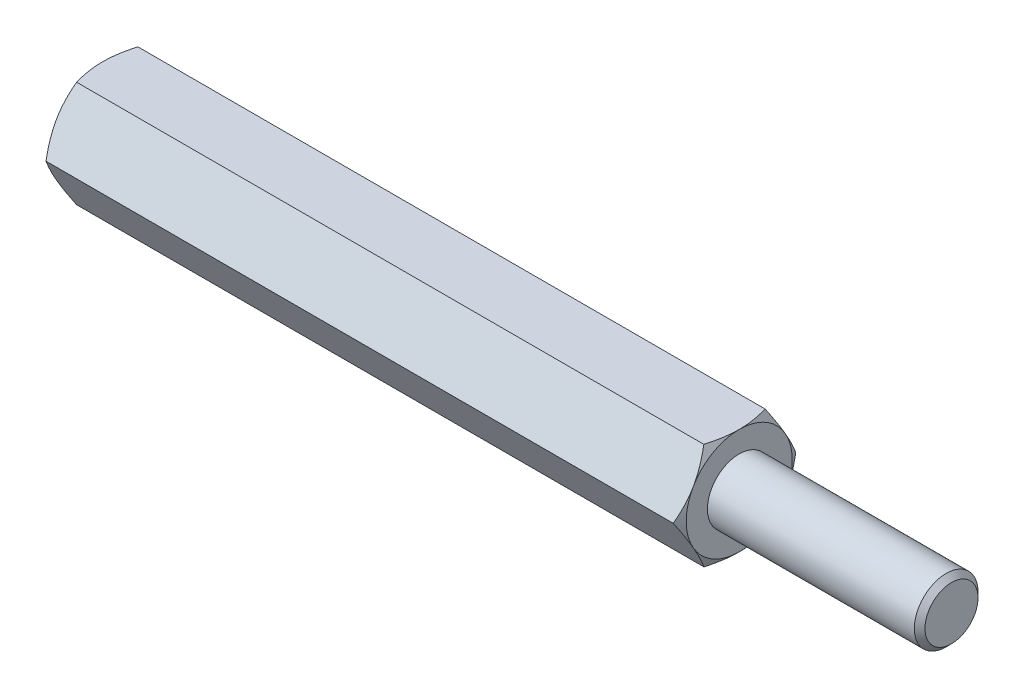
ISO-10303-21;
HEADER;
FILE_DESCRIPTION(('STEP AP214'),'2;1');
FILE_NAME('part.step','',(''),(''),'','','');
FILE_SCHEMA(('AUTOMOTIVE_DESIGN { 1 0 10303 214 1 1 1 1 }'));
ENDSEC;
DATA;
#1=APPLICATION_CONTEXT('core data for automotive mechanical design processes');
#2=APPLICATION_PROTOCOL_DEFINITION('international standard','automotive_design',2000,#1);
#3=PRODUCT_CONTEXT('',#1,'mechanical');
#4=PRODUCT('Part','Part','',(#3));
#5=PRODUCT_RELATED_PRODUCT_CATEGORY('part','',(#4));
#6=PRODUCT_DEFINITION_FORMATION('','',#4);
#7=PRODUCT_DEFINITION_CONTEXT('part definition',#1,'design');
#8=PRODUCT_DEFINITION('design','',#6,#7);
#9=PRODUCT_DEFINITION_SHAPE('','',#8);
#10=(LENGTH_UNIT() NAMED_UNIT(*) SI_UNIT(.MILLI.,.METRE.));
#11=(NAMED_UNIT(*) PLANE_ANGLE_UNIT() SI_UNIT($,.RADIAN.));
#12=(NAMED_UNIT(*) SI_UNIT($,.STERADIAN.) SOLID_ANGLE_UNIT());
#13=UNCERTAINTY_MEASURE_WITH_UNIT(LENGTH_MEASURE(1.E-05),#10,'distance_accuracy_value','');
#14=(GEOMETRIC_REPRESENTATION_CONTEXT(3) GLOBAL_UNCERTAINTY_ASSIGNED_CONTEXT((#13)) GLOBAL_UNIT_ASSIGNED_CONTEXT((#10,
#11,#12)) REPRESENTATION_CONTEXT('',''));
#15=CARTESIAN_POINT('',(0.,0.,0.));
#16=DIRECTION('',(0.,0.,1.));
#17=DIRECTION('',(1.,0.,0.));
#18=AXIS2_PLACEMENT_3D('',#15,#16,#17);
#19=CARTESIAN_POINT('',(15.,2.5,-1.44337567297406));
#20=DIRECTION('',(1.,0.,0.));
#21=DIRECTION('',(0.,0.,-1.));
#22=AXIS2_PLACEMENT_3D('',#19,#20,#21);
#23=PLANE('',#22);
#24=CARTESIAN_POINT('',(15.,0.,0.));
#25=DIRECTION('',(1.,0.,0.));
#26=DIRECTION('',(0.,0.,-1.));
#27=AXIS2_PLACEMENT_3D('',#24,#25,#26);
#28=CIRCLE('',#27,2.5);
#29=CARTESIAN_POINT('',(15.,-1.25,-2.1650635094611));
#30=VERTEX_POINT('',#29);
#31=CARTESIAN_POINT('',(15.,1.25,-2.1650635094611));
#32=VERTEX_POINT('',#31);
#33=EDGE_CURVE('E288',#30,#32,#28,.T.);
#34=ORIENTED_EDGE('',*,*,#33,.T.);
#35=CARTESIAN_POINT('',(15.,2.5,0.));
#36=VERTEX_POINT('',#35);
#37=EDGE_CURVE('E53',#32,#36,#28,.T.);
#38=ORIENTED_EDGE('',*,*,#37,.T.);
#39=CARTESIAN_POINT('',(15.,1.25,2.1650635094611));
#40=VERTEX_POINT('',#39);
#41=EDGE_CURVE('E295',#36,#40,#28,.T.);
#42=ORIENTED_EDGE('',*,*,#41,.T.);
#43=CARTESIAN_POINT('',(15.,-1.25000000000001,2.1650635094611));
#44=VERTEX_POINT('',#43);
#45=EDGE_CURVE('E300',#40,#44,#28,.T.);
#46=ORIENTED_EDGE('',*,*,#45,.T.);
#47=CARTESIAN_POINT('',(15.,0.,0.));
#48=DIRECTION('',(-1.,0.,0.));
#49=DIRECTION('',(0.,-1.,0.));
#50=AXIS2_PLACEMENT_3D('',#47,#48,#49);
#51=CIRCLE('',#50,2.5);
#52=CARTESIAN_POINT('',(15.,-2.50000000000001,0.));
#53=VERTEX_POINT('',#52);
#54=EDGE_CURVE('E193',#53,#44,#51,.T.);
#55=ORIENTED_EDGE('',*,*,#54,.F.);
#56=EDGE_CURVE('E61',#53,#30,#28,.T.);
#57=ORIENTED_EDGE('',*,*,#56,.T.);
#58=EDGE_LOOP('',(#34,#38,#42,#46,#55,#57));
#59=FACE_BOUND('',#58,.T.);
#60=CARTESIAN_POINT('',(15.,0.,0.));
#61=DIRECTION('',(1.,0.,0.));
#62=DIRECTION('',(0.,0.,-1.));
#63=AXIS2_PLACEMENT_3D('',#60,#61,#62);
#64=CIRCLE('',#63,1.5);
#65=CARTESIAN_POINT('',(15.,0.,-1.5));
#66=VERTEX_POINT('',#65);
#67=EDGE_CURVE('E312',#66,#66,#64,.T.);
#68=ORIENTED_EDGE('',*,*,#67,.F.);
#69=EDGE_LOOP('',(#68));
#70=FACE_BOUND('',#69,.T.);
#71=ADVANCED_FACE('F37',(#59,#70),#23,.T.);
#72=CARTESIAN_POINT('',(15.,0.,-2.88675134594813));
#73=DIRECTION('',(0.,-0.5,0.866025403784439));
#74=DIRECTION('',(0.,-0.866025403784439,-0.5));
#75=AXIS2_PLACEMENT_3D('',#72,#73,#74);
#76=PLANE('',#75);
#77=CARTESIAN_POINT('',(14.7766423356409,-0.000199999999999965,-2.88686681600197));
#78=CARTESIAN_POINT('',(14.8132783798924,0.109663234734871,-2.82343724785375));
#79=CARTESIAN_POINT('',(14.8465977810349,0.220474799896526,-2.75946016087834));
#80=CARTESIAN_POINT('',(14.9047577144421,0.444016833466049,-2.63039810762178));
#81=CARTESIAN_POINT('',(14.9295776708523,0.556751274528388,-2.5653108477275));
#82=CARTESIAN_POINT('',(14.968214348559,0.780822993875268,-2.43594298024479));
#83=CARTESIAN_POINT('',(14.9822882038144,0.892125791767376,-2.37168227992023));
#84=CARTESIAN_POINT('',(14.9990908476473,1.11525522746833,-2.24285844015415));
#85=CARTESIAN_POINT('',(15.0018335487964,1.22708105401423,-2.17829576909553));
#86=CARTESIAN_POINT('',(14.9961342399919,1.43604197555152,-2.05765212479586));
#87=CARTESIAN_POINT('',(14.9890916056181,1.53320831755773,-2.0015531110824));
#88=CARTESIAN_POINT('',(14.9667685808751,1.726907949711,-1.88972057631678));
#89=CARTESIAN_POINT('',(14.9514805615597,1.82344056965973,-1.8339874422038));
#90=CARTESIAN_POINT('',(14.9132609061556,2.01753972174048,-1.7219242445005));
#91=CARTESIAN_POINT('',(14.8901672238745,2.11508168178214,-1.66560836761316));
#92=CARTESIAN_POINT('',(14.8377533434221,2.30871060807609,-1.55381665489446));
#93=CARTESIAN_POINT('',(14.8084454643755,2.40480005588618,-1.49833938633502));
#94=CARTESIAN_POINT('',(14.7766423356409,2.5002,-1.44326020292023));
#95=B_SPLINE_CURVE_WITH_KNOTS('',3,(#77,#78,#79,#80,#81,#82,#83,#84,#85,#86,#87,#88,#89,#90,#91,
#92,#93,#94),.UNSPECIFIED.,.F.,.F.,(4,2,2,2,2,2,2,2,4),(0.,0.396285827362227,0.79352433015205,
1.18093086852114,1.56786160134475,1.90479741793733,2.24204551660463,2.58677531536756,
2.93082800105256),.UNSPECIFIED.);
#96=CARTESIAN_POINT('',(14.7767090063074,0.,-2.88675134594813));
#97=VERTEX_POINT('',#96);
#98=EDGE_CURVE('E355',#97,#32,#95,.T.);
#99=ORIENTED_EDGE('',*,*,#98,.F.);
#100=DIRECTION('',(-1.,0.,0.));
#101=VECTOR('',#100,1.);
#102=CARTESIAN_POINT('',(15.,0.,-2.88675134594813));
#103=LINE('',#102,#101);
#104=CARTESIAN_POINT('',(-14.7767090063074,0.,-2.88675134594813));
#105=VERTEX_POINT('',#104);
#106=EDGE_CURVE('E264',#97,#105,#103,.T.);
#107=ORIENTED_EDGE('',*,*,#106,.T.);
#108=CARTESIAN_POINT('',(-14.7766423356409,2.5002,-1.44326020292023));
#109=CARTESIAN_POINT('',(-14.8132783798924,2.39033676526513,-1.50668977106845));
#110=CARTESIAN_POINT('',(-14.8465977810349,2.27952520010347,-1.57066685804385));
#111=CARTESIAN_POINT('',(-14.9047577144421,2.05598316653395,-1.69972891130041));
#112=CARTESIAN_POINT('',(-14.9295776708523,1.94324872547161,-1.7648161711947));
#113=CARTESIAN_POINT('',(-14.968214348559,1.71917700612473,-1.8941840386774));
#114=CARTESIAN_POINT('',(-14.9822882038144,1.60787420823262,-1.95844473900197));
#115=CARTESIAN_POINT('',(-14.9990908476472,1.38474477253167,-2.08726857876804));
#116=CARTESIAN_POINT('',(-15.0018335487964,1.27291894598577,-2.15183124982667));
#117=CARTESIAN_POINT('',(-14.9961342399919,1.06395802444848,-2.27247489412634));
#118=CARTESIAN_POINT('',(-14.9890916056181,0.96679168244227,-2.32857390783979));
#119=CARTESIAN_POINT('',(-14.9667685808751,0.773092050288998,-2.44040644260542));
#120=CARTESIAN_POINT('',(-14.9514805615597,0.676559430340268,-2.49613957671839));
#121=CARTESIAN_POINT('',(-14.9132609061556,0.482460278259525,-2.60820277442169));
#122=CARTESIAN_POINT('',(-14.8901672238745,0.38491831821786,-2.66451865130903));
#123=CARTESIAN_POINT('',(-14.8377533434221,0.191289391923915,-2.77631036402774));
#124=CARTESIAN_POINT('',(-14.8084454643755,0.0951999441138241,-2.83178763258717));
#125=CARTESIAN_POINT('',(-14.7766423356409,-0.000199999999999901,-2.88686681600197));
#126=B_SPLINE_CURVE_WITH_KNOTS('',3,(#108,#109,#110,#111,#112,#113,#114,#115,#116,#117,#118,
#119,#120,#121,#122,#123,#124,#125),.UNSPECIFIED.,.F.,.F.,(4,2,2,2,2,2,2,2,4),(0.,
0.396285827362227,0.79352433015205,1.18093086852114,1.56786160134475,1.90479741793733,
2.24204551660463,2.58677531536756,2.93082800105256),.UNSPECIFIED.);
#127=CARTESIAN_POINT('',(-15.,1.25,-2.1650635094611));
#128=VERTEX_POINT('',#127);
#129=EDGE_CURVE('E398',#128,#105,#126,.T.);
#130=ORIENTED_EDGE('',*,*,#129,.F.);
#131=CARTESIAN_POINT('',(-14.7767090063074,2.5,-1.44337567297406));
#132=VERTEX_POINT('',#131);
#133=EDGE_CURVE('E393',#132,#128,#126,.T.);
#134=ORIENTED_EDGE('',*,*,#133,.F.);
#135=DIRECTION('',(-1.,0.,0.));
#136=VECTOR('',#135,1.);
#137=CARTESIAN_POINT('',(15.,2.5,-1.44337567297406));
#138=LINE('',#137,#136);
#139=CARTESIAN_POINT('',(14.7767090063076,2.5,-1.44337567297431));
#140=VERTEX_POINT('',#139);
#141=EDGE_CURVE('E279',#140,#132,#138,.T.);
#142=ORIENTED_EDGE('',*,*,#141,.F.);
#143=EDGE_CURVE('E229',#32,#140,#95,.T.);
#144=ORIENTED_EDGE('',*,*,#143,.F.);
#145=EDGE_LOOP('',(#99,#107,#130,#134,#142,#144));
#146=FACE_BOUND('',#145,.T.);
#147=ADVANCED_FACE('F148',(#146),#76,.F.);
#148=CARTESIAN_POINT('',(15.,2.5,-1.44337567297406));
#149=DIRECTION('',(0.,-1.,0.));
#150=DIRECTION('',(0.,0.,-1.));
#151=AXIS2_PLACEMENT_3D('',#148,#149,#150);
#152=PLANE('',#151);
#153=CARTESIAN_POINT('',(13.7680338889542,2.5,-3.90158441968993));
#154=CARTESIAN_POINT('',(13.8212077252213,2.5,-3.79217004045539));
#155=CARTESIAN_POINT('',(13.8738786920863,2.5,-3.68250707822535));
#156=CARTESIAN_POINT('',(13.9779324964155,2.5,-3.46255185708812));
#157=CARTESIAN_POINT('',(14.0293151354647,2.5,-3.35225950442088));
#158=CARTESIAN_POINT('',(14.1307630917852,2.5,-3.13035696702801));
#159=CARTESIAN_POINT('',(14.1808199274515,2.5,-3.0187428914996));
#160=CARTESIAN_POINT('',(14.2789171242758,2.5,-2.79463535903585));
#161=CARTESIAN_POINT('',(14.3269575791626,2.5,-2.68214194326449));
#162=CARTESIAN_POINT('',(14.4220184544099,2.5,-2.45240385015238));
#163=CARTESIAN_POINT('',(14.4689543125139,2.5,-2.33512399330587));
#164=CARTESIAN_POINT('',(14.5593326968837,2.5,-2.09920133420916));
#165=CARTESIAN_POINT('',(14.6027748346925,2.5,-1.98055838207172));
#166=CARTESIAN_POINT('',(14.6850435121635,2.5,-1.74193489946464));
#167=CARTESIAN_POINT('',(14.7238791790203,2.5,-1.6219575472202));
#168=CARTESIAN_POINT('',(14.7957050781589,2.5,-1.38028205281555));
#169=CARTESIAN_POINT('',(14.8286971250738,2.5,-1.25858445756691));
#170=CARTESIAN_POINT('',(14.8870959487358,2.5,-1.01406369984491));
#171=CARTESIAN_POINT('',(14.9125437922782,2.5,-0.891250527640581));
#172=CARTESIAN_POINT('',(14.9544275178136,2.5,-0.64407172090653));
#173=CARTESIAN_POINT('',(14.9708643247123,2.5,-0.519706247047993));
#174=CARTESIAN_POINT('',(14.9932006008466,2.5,-0.271679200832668));
#175=CARTESIAN_POINT('',(14.9992375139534,2.5,-0.148030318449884));
#176=CARTESIAN_POINT('',(15.0006256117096,2.5,0.099339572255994));
#177=CARTESIAN_POINT('',(14.9959765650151,2.5,0.223060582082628));
#178=CARTESIAN_POINT('',(14.9794044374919,2.5,0.432351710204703));
#179=CARTESIAN_POINT('',(14.9701066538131,2.5,0.518143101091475));
#180=CARTESIAN_POINT('',(14.9469384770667,2.5,0.689112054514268));
#181=CARTESIAN_POINT('',(14.9330674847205,2.5,0.774289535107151));
#182=CARTESIAN_POINT('',(14.8853202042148,2.5,1.02876599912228));
#183=CARTESIAN_POINT('',(14.8453176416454,2.5,1.19691958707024));
#184=CARTESIAN_POINT('',(14.7522656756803,2.5,1.53362893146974));
#185=CARTESIAN_POINT('',(14.6989362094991,2.5,1.70210423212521));
#186=CARTESIAN_POINT('',(14.6123716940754,2.5,1.95247339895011));
#187=CARTESIAN_POINT('',(14.5824247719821,2.5,2.03553184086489));
#188=CARTESIAN_POINT('',(14.5206840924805,2.5,2.20095860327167));
#189=CARTESIAN_POINT('',(14.4888903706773,2.5,2.2833269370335));
#190=CARTESIAN_POINT('',(14.404014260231,2.5,2.49723312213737));
#191=CARTESIAN_POINT('',(14.3497173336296,2.5,2.6282879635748));
#192=CARTESIAN_POINT('',(14.2381273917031,2.5,2.88912034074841));
#193=CARTESIAN_POINT('',(14.1808341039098,2.5,3.01889775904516));
#194=CARTESIAN_POINT('',(14.0639348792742,2.5,3.27745045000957));
#195=CARTESIAN_POINT('',(14.004328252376,2.5,3.40622540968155));
#196=CARTESIAN_POINT('',(13.8833234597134,2.5,3.66293235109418));
#197=CARTESIAN_POINT('',(13.821925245,2.5,3.79086430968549));
#198=CARTESIAN_POINT('',(13.6354580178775,2.5,4.17399495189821));
#199=CARTESIAN_POINT('',(13.5082824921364,2.5,4.42816724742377));
#200=CARTESIAN_POINT('',(13.2503455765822,2.5,4.93461464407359));
#201=CARTESIAN_POINT('',(13.1195848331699,2.5,5.18689007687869));
#202=CARTESIAN_POINT('',(12.8687100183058,2.5,5.66512451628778));
#203=CARTESIAN_POINT('',(12.7488298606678,2.5,5.89120644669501));
#204=CARTESIAN_POINT('',(12.5075902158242,2.5,6.34259369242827));
#205=CARTESIAN_POINT('',(12.3862306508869,2.5,6.56789896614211));
#206=CARTESIAN_POINT('',(12.142780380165,2.5,7.01722044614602));
#207=CARTESIAN_POINT('',(12.0206930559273,2.5,7.24123848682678));
#208=CARTESIAN_POINT('',(11.7756662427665,2.5,7.68878772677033));
#209=CARTESIAN_POINT('',(11.652726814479,2.5,7.9123189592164));
#210=CARTESIAN_POINT('',(11.5294756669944,2.5,8.13567697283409));
#211=B_SPLINE_CURVE_WITH_KNOTS('',3,(#153,#154,#155,#156,#157,#158,#159,#160,#161,#162,#163,
#164,#165,#166,#167,#168,#169,#170,#171,#172,#173,#174,#175,#176,#177,#178,#179,#180,#181,#182,
#183,#184,#185,#186,#187,#188,#189,#190,#191,#192,#193,#194,#195,#196,#197,#198,#199,#200,#201,
#202,#203,#204,#205,#206,#207,#208,#209,#210),.UNSPECIFIED.,.F.,.F.,(4,2,2,2,2,2,2,2,2,2,2,2,2,
2,2,2,2,2,2,2,2,2,2,2,2,2,2,2,4),(0.,0.364957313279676,0.729970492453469,1.09692930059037,
1.46387103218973,1.84279746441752,2.22176597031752,2.59997058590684,2.97805755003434,
3.3540469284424,3.72999770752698,4.10094071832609,4.47189175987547,4.73064905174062,
4.98944026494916,5.5072907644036,6.03710483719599,6.30196454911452,6.56681915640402,
6.99233818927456,7.41789598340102,7.84358170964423,8.26927907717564,9.12186602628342,
9.9743002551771,10.7419897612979,11.5097197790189,12.2750964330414,13.0404191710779),.UNSPECIFIED.);
#212=EDGE_CURVE('E227',#140,#36,#211,.T.);
#213=ORIENTED_EDGE('',*,*,#212,.F.);
#214=ORIENTED_EDGE('',*,*,#141,.T.);
#215=CARTESIAN_POINT('',(-13.7680338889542,2.5,-3.90158441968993));
#216=CARTESIAN_POINT('',(-13.8212077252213,2.5,-3.79217004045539));
#217=CARTESIAN_POINT('',(-13.8738786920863,2.5,-3.68250707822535));
#218=CARTESIAN_POINT('',(-13.9779324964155,2.5,-3.46255185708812));
#219=CARTESIAN_POINT('',(-14.0293151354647,2.5,-3.35225950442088));
#220=CARTESIAN_POINT('',(-14.1307630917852,2.5,-3.13035696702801));
#221=CARTESIAN_POINT('',(-14.1808199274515,2.5,-3.0187428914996));
#222=CARTESIAN_POINT('',(-14.2789171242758,2.5,-2.79463535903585));
#223=CARTESIAN_POINT('',(-14.3269575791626,2.5,-2.68214194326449));
#224=CARTESIAN_POINT('',(-14.4220184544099,2.5,-2.45240385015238));
#225=CARTESIAN_POINT('',(-14.4689543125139,2.5,-2.33512399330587));
#226=CARTESIAN_POINT('',(-14.5593326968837,2.5,-2.09920133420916));
#227=CARTESIAN_POINT('',(-14.6027748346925,2.5,-1.98055838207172));
#228=CARTESIAN_POINT('',(-14.6850435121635,2.5,-1.74193489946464));
#229=CARTESIAN_POINT('',(-14.7238791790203,2.5,-1.6219575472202));
#230=CARTESIAN_POINT('',(-14.7957050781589,2.5,-1.38028205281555));
#231=CARTESIAN_POINT('',(-14.8286971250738,2.5,-1.25858445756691));
#232=CARTESIAN_POINT('',(-14.8870959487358,2.5,-1.01406369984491));
#233=CARTESIAN_POINT('',(-14.9125437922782,2.5,-0.891250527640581));
#234=CARTESIAN_POINT('',(-14.9544275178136,2.5,-0.64407172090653));
#235=CARTESIAN_POINT('',(-14.9708643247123,2.5,-0.519706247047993));
#236=CARTESIAN_POINT('',(-14.9932006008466,2.5,-0.271679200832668));
#237=CARTESIAN_POINT('',(-14.9992375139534,2.5,-0.148030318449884));
#238=CARTESIAN_POINT('',(-15.0006256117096,2.5,0.099339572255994));
#239=CARTESIAN_POINT('',(-14.9959765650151,2.5,0.223060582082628));
#240=CARTESIAN_POINT('',(-14.9794044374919,2.5,0.432351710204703));
#241=CARTESIAN_POINT('',(-14.9701066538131,2.5,0.518143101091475));
#242=CARTESIAN_POINT('',(-14.9469384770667,2.5,0.689112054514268));
#243=CARTESIAN_POINT('',(-14.9330674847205,2.5,0.774289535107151));
#244=CARTESIAN_POINT('',(-14.8853202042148,2.5,1.02876599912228));
#245=CARTESIAN_POINT('',(-14.8453176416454,2.5,1.19691958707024));
#246=CARTESIAN_POINT('',(-14.7522656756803,2.5,1.53362893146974));
#247=CARTESIAN_POINT('',(-14.6989362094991,2.5,1.70210423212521));
#248=CARTESIAN_POINT('',(-14.6123716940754,2.5,1.95247339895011));
#249=CARTESIAN_POINT('',(-14.5824247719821,2.5,2.03553184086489));
#250=CARTESIAN_POINT('',(-14.5206840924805,2.5,2.20095860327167));
#251=CARTESIAN_POINT('',(-14.4888903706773,2.5,2.2833269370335));
#252=CARTESIAN_POINT('',(-14.404014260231,2.5,2.49723312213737));
#253=CARTESIAN_POINT('',(-14.3497173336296,2.5,2.6282879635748));
#254=CARTESIAN_POINT('',(-14.2381273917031,2.5,2.88912034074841));
#255=CARTESIAN_POINT('',(-14.1808341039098,2.5,3.01889775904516));
#256=CARTESIAN_POINT('',(-14.0639348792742,2.5,3.27745045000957));
#257=CARTESIAN_POINT('',(-14.004328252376,2.5,3.40622540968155));
#258=CARTESIAN_POINT('',(-13.8833234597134,2.5,3.66293235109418));
#259=CARTESIAN_POINT('',(-13.821925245,2.5,3.79086430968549));
#260=CARTESIAN_POINT('',(-13.6354580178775,2.5,4.17399495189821));
#261=CARTESIAN_POINT('',(-13.5082824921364,2.5,4.42816724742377));
#262=CARTESIAN_POINT('',(-13.2503455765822,2.5,4.93461464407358));
#263=CARTESIAN_POINT('',(-13.1195848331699,2.5,5.18689007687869));
#264=CARTESIAN_POINT('',(-12.8687100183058,2.5,5.66512451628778));
#265=CARTESIAN_POINT('',(-12.7488298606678,2.5,5.89120644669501));
#266=CARTESIAN_POINT('',(-12.5075902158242,2.5,6.34259369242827));
#267=CARTESIAN_POINT('',(-12.3862306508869,2.5,6.56789896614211));
#268=CARTESIAN_POINT('',(-12.142780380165,2.5,7.01722044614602));
#269=CARTESIAN_POINT('',(-12.0206930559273,2.5,7.24123848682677));
#270=CARTESIAN_POINT('',(-11.7756662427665,2.5,7.68878772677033));
#271=CARTESIAN_POINT('',(-11.652726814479,2.5,7.9123189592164));
#272=CARTESIAN_POINT('',(-11.5294756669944,2.5,8.13567697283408));
#273=B_SPLINE_CURVE_WITH_KNOTS('',3,(#215,#216,#217,#218,#219,#220,#221,#222,#223,#224,#225,
#226,#227,#228,#229,#230,#231,#232,#233,#234,#235,#236,#237,#238,#239,#240,#241,#242,#243,#244,
#245,#246,#247,#248,#249,#250,#251,#252,#253,#254,#255,#256,#257,#258,#259,#260,#261,#262,#263,
#264,#265,#266,#267,#268,#269,#270,#271,#272),.UNSPECIFIED.,.F.,.F.,(4,2,2,2,2,2,2,2,2,2,2,2,2,
2,2,2,2,2,2,2,2,2,2,2,2,2,2,2,4),(0.,0.364957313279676,0.729970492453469,1.09692930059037,
1.46387103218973,1.84279746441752,2.22176597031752,2.59997058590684,2.97805755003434,
3.3540469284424,3.72999770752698,4.10094071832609,4.47189175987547,4.73064905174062,
4.98944026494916,5.5072907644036,6.03710483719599,6.30196454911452,6.56681915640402,
6.99233818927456,7.41789598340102,7.84358170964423,8.26927907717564,9.12186602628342,
9.9743002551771,10.7419897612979,11.5097197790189,12.2750964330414,13.0404191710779),.UNSPECIFIED.);
#274=CARTESIAN_POINT('',(-15.,2.5,0.));
#275=VERTEX_POINT('',#274);
#276=EDGE_CURVE('E241',#275,#132,#273,.F.);
#277=ORIENTED_EDGE('',*,*,#276,.F.);
#278=CARTESIAN_POINT('',(-14.7767090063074,2.5,1.44337567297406));
#279=VERTEX_POINT('',#278);
#280=EDGE_CURVE('E249',#279,#275,#273,.F.);
#281=ORIENTED_EDGE('',*,*,#280,.F.);
#282=DIRECTION('',(-1.,0.,0.));
#283=VECTOR('',#282,1.);
#284=CARTESIAN_POINT('',(15.,2.5,1.44337567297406));
#285=LINE('',#284,#283);
#286=CARTESIAN_POINT('',(14.7767090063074,2.5,1.44337567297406));
#287=VERTEX_POINT('',#286);
#288=EDGE_CURVE('E276',#287,#279,#285,.T.);
#289=ORIENTED_EDGE('',*,*,#288,.F.);
#290=EDGE_CURVE('E221',#36,#287,#211,.T.);
#291=ORIENTED_EDGE('',*,*,#290,.F.);
#292=EDGE_LOOP('',(#213,#214,#277,#281,#289,#291));
#293=FACE_BOUND('',#292,.T.);
#294=ADVANCED_FACE('F153',(#293),#152,.F.);
#295=CARTESIAN_POINT('',(15.,2.5,1.44337567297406));
#296=DIRECTION('',(0.,-0.5,-0.866025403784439));
#297=DIRECTION('',(0.,0.866025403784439,-0.5));
#298=AXIS2_PLACEMENT_3D('',#295,#296,#297);
#299=PLANE('',#298);
#300=CARTESIAN_POINT('',(14.7766423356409,2.5002,1.44326020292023));
#301=CARTESIAN_POINT('',(14.8132783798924,2.39033676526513,1.50668977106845));
#302=CARTESIAN_POINT('',(14.8465977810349,2.27952520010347,1.57066685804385));
#303=CARTESIAN_POINT('',(14.9047577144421,2.05598316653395,1.69972891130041));
#304=CARTESIAN_POINT('',(14.9295776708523,1.94324872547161,1.7648161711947));
#305=CARTESIAN_POINT('',(14.968214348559,1.71917700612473,1.8941840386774));
#306=CARTESIAN_POINT('',(14.9822882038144,1.60787420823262,1.95844473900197));
#307=CARTESIAN_POINT('',(14.9990908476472,1.38474477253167,2.08726857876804));
#308=CARTESIAN_POINT('',(15.0018335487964,1.27291894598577,2.15183124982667));
#309=CARTESIAN_POINT('',(14.9961342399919,1.06395802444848,2.27247489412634));
#310=CARTESIAN_POINT('',(14.9890916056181,0.966791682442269,2.32857390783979));
#311=CARTESIAN_POINT('',(14.9667685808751,0.773092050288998,2.44040644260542));
#312=CARTESIAN_POINT('',(14.9514805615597,0.676559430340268,2.49613957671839));
#313=CARTESIAN_POINT('',(14.9132609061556,0.482460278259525,2.60820277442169));
#314=CARTESIAN_POINT('',(14.8901672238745,0.38491831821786,2.66451865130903));
#315=CARTESIAN_POINT('',(14.8377533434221,0.191289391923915,2.77631036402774));
#316=CARTESIAN_POINT('',(14.8084454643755,0.0951999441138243,2.83178763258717));
#317=CARTESIAN_POINT('',(14.7766423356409,-0.00019999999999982,2.88686681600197));
#318=B_SPLINE_CURVE_WITH_KNOTS('',3,(#300,#301,#302,#303,#304,#305,#306,#307,#308,#309,#310,
#311,#312,#313,#314,#315,#316,#317),.UNSPECIFIED.,.F.,.F.,(4,2,2,2,2,2,2,2,4),(0.,
0.396285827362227,0.79352433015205,1.18093086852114,1.56786160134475,1.90479741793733,
2.24204551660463,2.58677531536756,2.93082800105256),.UNSPECIFIED.);
#319=EDGE_CURVE('E228',#287,#40,#318,.T.);
#320=ORIENTED_EDGE('',*,*,#319,.F.);
#321=ORIENTED_EDGE('',*,*,#288,.T.);
#322=CARTESIAN_POINT('',(-14.7766423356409,-0.000199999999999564,2.88686681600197));
#323=CARTESIAN_POINT('',(-14.8132783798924,0.109663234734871,2.82343724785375));
#324=CARTESIAN_POINT('',(-14.8465977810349,0.220474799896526,2.75946016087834));
#325=CARTESIAN_POINT('',(-14.9047577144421,0.44401683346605,2.63039810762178));
#326=CARTESIAN_POINT('',(-14.9295776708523,0.556751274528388,2.5653108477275));
#327=CARTESIAN_POINT('',(-14.968214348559,0.780822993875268,2.43594298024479));
#328=CARTESIAN_POINT('',(-14.9822882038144,0.892125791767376,2.37168227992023));
#329=CARTESIAN_POINT('',(-14.9990908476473,1.11525522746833,2.24285844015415));
#330=CARTESIAN_POINT('',(-15.0018335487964,1.22708105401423,2.17829576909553));
#331=CARTESIAN_POINT('',(-14.9961342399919,1.43604197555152,2.05765212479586));
#332=CARTESIAN_POINT('',(-14.9890916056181,1.53320831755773,2.0015531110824));
#333=CARTESIAN_POINT('',(-14.9667685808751,1.726907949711,1.88972057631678));
#334=CARTESIAN_POINT('',(-14.9514805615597,1.82344056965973,1.8339874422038));
#335=CARTESIAN_POINT('',(-14.9132609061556,2.01753972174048,1.7219242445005));
#336=CARTESIAN_POINT('',(-14.8901672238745,2.11508168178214,1.66560836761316));
#337=CARTESIAN_POINT('',(-14.8377533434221,2.30871060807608,1.55381665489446));
#338=CARTESIAN_POINT('',(-14.8084454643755,2.40480005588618,1.49833938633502));
#339=CARTESIAN_POINT('',(-14.7766423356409,2.5002,1.44326020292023));
#340=B_SPLINE_CURVE_WITH_KNOTS('',3,(#322,#323,#324,#325,#326,#327,#328,#329,#330,#331,#332,
#333,#334,#335,#336,#337,#338,#339),.UNSPECIFIED.,.F.,.F.,(4,2,2,2,2,2,2,2,4),(0.,
0.396285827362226,0.79352433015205,1.18093086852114,1.56786160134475,1.90479741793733,
2.24204551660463,2.58677531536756,2.93082800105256),.UNSPECIFIED.);
#341=CARTESIAN_POINT('',(-15.,1.25,2.1650635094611));
#342=VERTEX_POINT('',#341);
#343=EDGE_CURVE('E255',#342,#279,#340,.T.);
#344=ORIENTED_EDGE('',*,*,#343,.F.);
#345=CARTESIAN_POINT('',(-14.7767090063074,0.,2.88675134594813));
#346=VERTEX_POINT('',#345);
#347=EDGE_CURVE('E262',#346,#342,#340,.T.);
#348=ORIENTED_EDGE('',*,*,#347,.F.);
#349=DIRECTION('',(-1.,0.,0.));
#350=VECTOR('',#349,1.);
#351=CARTESIAN_POINT('',(15.,0.,2.88675134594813));
#352=LINE('',#351,#350);
#353=CARTESIAN_POINT('',(14.7767090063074,0.,2.88675134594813));
#354=VERTEX_POINT('',#353);
#355=EDGE_CURVE('E273',#354,#346,#352,.T.);
#356=ORIENTED_EDGE('',*,*,#355,.F.);
#357=EDGE_CURVE('E215',#40,#354,#318,.T.);
#358=ORIENTED_EDGE('',*,*,#357,.F.);
#359=EDGE_LOOP('',(#320,#321,#344,#348,#356,#358));
#360=FACE_BOUND('',#359,.T.);
#361=ADVANCED_FACE('F235',(#360),#299,.F.);
#362=CARTESIAN_POINT('',(15.,0.,2.88675134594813));
#363=DIRECTION('',(0.,0.5,-0.866025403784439));
#364=DIRECTION('',(0.,0.866025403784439,0.5));
#365=AXIS2_PLACEMENT_3D('',#362,#363,#364);
#366=PLANE('',#365);
#367=CARTESIAN_POINT('',(14.7766423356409,0.000200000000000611,2.88686681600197));
#368=CARTESIAN_POINT('',(14.8132783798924,-0.10966323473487,2.82343724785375));
#369=CARTESIAN_POINT('',(14.8465977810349,-0.220474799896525,2.75946016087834));
#370=CARTESIAN_POINT('',(14.9047577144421,-0.444016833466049,2.63039810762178));
#371=CARTESIAN_POINT('',(14.9295776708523,-0.556751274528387,2.5653108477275));
#372=CARTESIAN_POINT('',(14.968214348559,-0.780822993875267,2.43594298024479));
#373=CARTESIAN_POINT('',(14.9822882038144,-0.892125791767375,2.37168227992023));
#374=CARTESIAN_POINT('',(14.9990908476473,-1.11525522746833,2.24285844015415));
#375=CARTESIAN_POINT('',(15.0018335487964,-1.22708105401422,2.17829576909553));
#376=CARTESIAN_POINT('',(14.9961342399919,-1.43604197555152,2.05765212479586));
#377=CARTESIAN_POINT('',(14.9890916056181,-1.53320831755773,2.0015531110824));
#378=CARTESIAN_POINT('',(14.9667685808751,-1.726907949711,1.88972057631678));
#379=CARTESIAN_POINT('',(14.9514805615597,-1.82344056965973,1.8339874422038));
#380=CARTESIAN_POINT('',(14.9132609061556,-2.01753972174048,1.7219242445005));
#381=CARTESIAN_POINT('',(14.8901672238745,-2.11508168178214,1.66560836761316));
#382=CARTESIAN_POINT('',(14.8377533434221,-2.30871060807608,1.55381665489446));
#383=CARTESIAN_POINT('',(14.8084454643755,-2.40480005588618,1.49833938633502));
#384=CARTESIAN_POINT('',(14.7766423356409,-2.5002,1.44326020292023));
#385=B_SPLINE_CURVE_WITH_KNOTS('',3,(#367,#368,#369,#370,#371,#372,#373,#374,#375,#376,#377,
#378,#379,#380,#381,#382,#383,#384),.UNSPECIFIED.,.F.,.F.,(4,2,2,2,2,2,2,2,4),(0.,
0.396285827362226,0.79352433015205,1.18093086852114,1.56786160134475,1.90479741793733,
2.24204551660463,2.58677531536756,2.93082800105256),.UNSPECIFIED.);
#386=EDGE_CURVE('E373',#354,#44,#385,.T.);
#387=ORIENTED_EDGE('',*,*,#386,.F.);
#388=ORIENTED_EDGE('',*,*,#355,.T.);
#389=CARTESIAN_POINT('',(-14.7766423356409,-2.5002,1.44326020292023));
#390=CARTESIAN_POINT('',(-14.8132783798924,-2.39033676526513,1.50668977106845));
#391=CARTESIAN_POINT('',(-14.8465977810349,-2.27952520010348,1.57066685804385));
#392=CARTESIAN_POINT('',(-14.9047577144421,-2.05598316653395,1.69972891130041));
#393=CARTESIAN_POINT('',(-14.9295776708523,-1.94324872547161,1.7648161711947));
#394=CARTESIAN_POINT('',(-14.968214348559,-1.71917700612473,1.8941840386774));
#395=CARTESIAN_POINT('',(-14.9822882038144,-1.60787420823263,1.95844473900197));
#396=CARTESIAN_POINT('',(-14.9990908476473,-1.38474477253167,2.08726857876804));
#397=CARTESIAN_POINT('',(-15.0018335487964,-1.27291894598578,2.15183124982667));
#398=CARTESIAN_POINT('',(-14.9961342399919,-1.06395802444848,2.27247489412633));
#399=CARTESIAN_POINT('',(-14.9890916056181,-0.966791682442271,2.32857390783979));
#400=CARTESIAN_POINT('',(-14.9667685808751,-0.773092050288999,2.44040644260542));
#401=CARTESIAN_POINT('',(-14.9514805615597,-0.676559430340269,2.49613957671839));
#402=CARTESIAN_POINT('',(-14.9132609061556,-0.482460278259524,2.60820277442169));
#403=CARTESIAN_POINT('',(-14.8901672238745,-0.384918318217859,2.66451865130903));
#404=CARTESIAN_POINT('',(-14.8377533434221,-0.191289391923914,2.77631036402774));
#405=CARTESIAN_POINT('',(-14.8084454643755,-0.0951999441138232,2.83178763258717));
#406=CARTESIAN_POINT('',(-14.7766423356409,0.000200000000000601,2.88686681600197));
#407=B_SPLINE_CURVE_WITH_KNOTS('',3,(#389,#390,#391,#392,#393,#394,#395,#396,#397,#398,#399,
#400,#401,#402,#403,#404,#405,#406),.UNSPECIFIED.,.F.,.F.,(4,2,2,2,2,2,2,2,4),(0.,
0.396285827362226,0.793524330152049,1.18093086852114,1.56786160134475,1.90479741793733,
2.24204551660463,2.58677531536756,2.93082800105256),.UNSPECIFIED.);
#408=CARTESIAN_POINT('',(-15.,-1.25000000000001,2.1650635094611));
#409=VERTEX_POINT('',#408);
#410=EDGE_CURVE('E263',#409,#346,#407,.T.);
#411=ORIENTED_EDGE('',*,*,#410,.F.);
#412=CARTESIAN_POINT('',(-14.7767090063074,-2.5,1.44337567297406));
#413=VERTEX_POINT('',#412);
#414=EDGE_CURVE('E250',#413,#409,#407,.T.);
#415=ORIENTED_EDGE('',*,*,#414,.F.);
#416=DIRECTION('',(-1.,0.,0.));
#417=VECTOR('',#416,1.);
#418=CARTESIAN_POINT('',(15.,-2.5,1.44337567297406));
#419=LINE('',#418,#417);
#420=CARTESIAN_POINT('',(14.7767090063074,-2.5,1.44337567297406));
#421=VERTEX_POINT('',#420);
#422=EDGE_CURVE('E270',#421,#413,#419,.T.);
#423=ORIENTED_EDGE('',*,*,#422,.F.);
#424=EDGE_CURVE('E210',#44,#421,#385,.T.);
#425=ORIENTED_EDGE('',*,*,#424,.F.);
#426=EDGE_LOOP('',(#387,#388,#411,#415,#423,#425));
#427=FACE_BOUND('',#426,.T.);
#428=ADVANCED_FACE('F437',(#427),#366,.F.);
#429=CARTESIAN_POINT('',(15.,-2.5,1.44337567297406));
#430=DIRECTION('',(0.,1.,0.));
#431=DIRECTION('',(0.,0.,1.));
#432=AXIS2_PLACEMENT_3D('',#429,#430,#431);
#433=PLANE('',#432);
#434=CARTESIAN_POINT('',(13.7680338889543,-2.5,-3.90158441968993));
#435=CARTESIAN_POINT('',(13.8212077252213,-2.5,-3.79217004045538));
#436=CARTESIAN_POINT('',(13.8738786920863,-2.5,-3.68250707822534));
#437=CARTESIAN_POINT('',(13.9779324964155,-2.5,-3.46255185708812));
#438=CARTESIAN_POINT('',(14.0293151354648,-2.5,-3.35225950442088));
#439=CARTESIAN_POINT('',(14.1307630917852,-2.5,-3.130356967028));
#440=CARTESIAN_POINT('',(14.1808199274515,-2.5,-3.01874289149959));
#441=CARTESIAN_POINT('',(14.2789171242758,-2.5,-2.79463535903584));
#442=CARTESIAN_POINT('',(14.3269575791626,-2.5,-2.68214194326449));
#443=CARTESIAN_POINT('',(14.4220184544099,-2.5,-2.45240385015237));
#444=CARTESIAN_POINT('',(14.4689543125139,-2.5,-2.33512399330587));
#445=CARTESIAN_POINT('',(14.5593326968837,-2.5,-2.09920133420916));
#446=CARTESIAN_POINT('',(14.6027748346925,-2.5,-1.98055838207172));
#447=CARTESIAN_POINT('',(14.6850435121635,-2.5,-1.74193489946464));
#448=CARTESIAN_POINT('',(14.7238791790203,-2.5,-1.6219575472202));
#449=CARTESIAN_POINT('',(14.7957050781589,-2.5,-1.38028205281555));
#450=CARTESIAN_POINT('',(14.8286971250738,-2.5,-1.25858445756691));
#451=CARTESIAN_POINT('',(14.8870959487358,-2.5,-1.01406369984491));
#452=CARTESIAN_POINT('',(14.9125437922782,-2.5,-0.891250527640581));
#453=CARTESIAN_POINT('',(14.9544275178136,-2.5,-0.644071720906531));
#454=CARTESIAN_POINT('',(14.9708643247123,-2.5,-0.519706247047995));
#455=CARTESIAN_POINT('',(14.9932006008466,-2.5,-0.27167920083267));
#456=CARTESIAN_POINT('',(14.9992375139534,-2.5,-0.148030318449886));
#457=CARTESIAN_POINT('',(15.0006256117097,-2.5,0.0993395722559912));
#458=CARTESIAN_POINT('',(14.9959765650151,-2.5,0.223060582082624));
#459=CARTESIAN_POINT('',(14.9794044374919,-2.5,0.432351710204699));
#460=CARTESIAN_POINT('',(14.9701066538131,-2.5,0.518143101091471));
#461=CARTESIAN_POINT('',(14.9469384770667,-2.5,0.689112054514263));
#462=CARTESIAN_POINT('',(14.9330674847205,-2.5,0.774289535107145));
#463=CARTESIAN_POINT('',(14.8853202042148,-2.5,1.02876599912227));
#464=CARTESIAN_POINT('',(14.8453176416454,-2.5,1.19691958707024));
#465=CARTESIAN_POINT('',(14.7522656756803,-2.5,1.53362893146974));
#466=CARTESIAN_POINT('',(14.6989362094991,-2.5,1.70210423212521));
#467=CARTESIAN_POINT('',(14.6123716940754,-2.5,1.95247339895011));
#468=CARTESIAN_POINT('',(14.5824247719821,-2.5,2.03553184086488));
#469=CARTESIAN_POINT('',(14.5206840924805,-2.5,2.20095860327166));
#470=CARTESIAN_POINT('',(14.4888903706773,-2.5,2.28332693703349));
#471=CARTESIAN_POINT('',(14.404014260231,-2.5,2.49723312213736));
#472=CARTESIAN_POINT('',(14.3497173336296,-2.5,2.62828796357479));
#473=CARTESIAN_POINT('',(14.2381273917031,-2.5,2.8891203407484));
#474=CARTESIAN_POINT('',(14.1808341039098,-2.5,3.01889775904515));
#475=CARTESIAN_POINT('',(14.0639348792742,-2.5,3.27745045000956));
#476=CARTESIAN_POINT('',(14.004328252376,-2.5,3.40622540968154));
#477=CARTESIAN_POINT('',(13.8833234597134,-2.5,3.66293235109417));
#478=CARTESIAN_POINT('',(13.821925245,-2.5,3.79086430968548));
#479=CARTESIAN_POINT('',(13.6354580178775,-2.5,4.1739949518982));
#480=CARTESIAN_POINT('',(13.5082824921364,-2.5,4.42816724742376));
#481=CARTESIAN_POINT('',(13.2503455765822,-2.5,4.93461464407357));
#482=CARTESIAN_POINT('',(13.1195848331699,-2.5,5.18689007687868));
#483=CARTESIAN_POINT('',(12.8687100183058,-2.5,5.66512451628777));
#484=CARTESIAN_POINT('',(12.7488298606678,-2.5,5.891206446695));
#485=CARTESIAN_POINT('',(12.5075902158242,-2.5,6.34259369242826));
#486=CARTESIAN_POINT('',(12.3862306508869,-2.5,6.5678989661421));
#487=CARTESIAN_POINT('',(12.142780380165,-2.5,7.01722044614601));
#488=CARTESIAN_POINT('',(12.0206930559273,-2.5,7.24123848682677));
#489=CARTESIAN_POINT('',(11.7756662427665,-2.5,7.68878772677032));
#490=CARTESIAN_POINT('',(11.652726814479,-2.5,7.91231895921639));
#491=CARTESIAN_POINT('',(11.5294756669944,-2.5,8.13567697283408));
#492=B_SPLINE_CURVE_WITH_KNOTS('',3,(#434,#435,#436,#437,#438,#439,#440,#441,#442,#443,#444,
#445,#446,#447,#448,#449,#450,#451,#452,#453,#454,#455,#456,#457,#458,#459,#460,#461,#462,#463,
#464,#465,#466,#467,#468,#469,#470,#471,#472,#473,#474,#475,#476,#477,#478,#479,#480,#481,#482,
#483,#484,#485,#486,#487,#488,#489,#490,#491),.UNSPECIFIED.,.F.,.F.,(4,2,2,2,2,2,2,2,2,2,2,2,2,
2,2,2,2,2,2,2,2,2,2,2,2,2,2,2,4),(0.,0.364957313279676,0.729970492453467,1.09692930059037,
1.46387103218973,1.84279746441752,2.22176597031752,2.59997058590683,2.97805755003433,
3.35404692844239,3.72999770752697,4.10094071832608,4.47189175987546,4.73064905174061,
4.98944026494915,5.50729076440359,6.03710483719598,6.30196454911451,6.56681915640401,
6.99233818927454,7.417895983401,7.84358170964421,8.26927907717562,9.1218660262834,
9.97430025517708,10.7419897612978,11.5097197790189,12.2750964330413,13.0404191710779),.UNSPECIFIED.);
#493=EDGE_CURVE('E380',#421,#53,#492,.F.);
#494=ORIENTED_EDGE('',*,*,#493,.F.);
#495=ORIENTED_EDGE('',*,*,#422,.T.);
#496=CARTESIAN_POINT('',(-13.7680338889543,-2.5,-3.90158441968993));
#497=CARTESIAN_POINT('',(-13.8212077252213,-2.5,-3.79217004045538));
#498=CARTESIAN_POINT('',(-13.8738786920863,-2.5,-3.68250707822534));
#499=CARTESIAN_POINT('',(-13.9779324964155,-2.5,-3.46255185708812));
#500=CARTESIAN_POINT('',(-14.0293151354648,-2.5,-3.35225950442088));
#501=CARTESIAN_POINT('',(-14.1307630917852,-2.5,-3.130356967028));
#502=CARTESIAN_POINT('',(-14.1808199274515,-2.5,-3.01874289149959));
#503=CARTESIAN_POINT('',(-14.2789171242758,-2.5,-2.79463535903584));
#504=CARTESIAN_POINT('',(-14.3269575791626,-2.5,-2.68214194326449));
#505=CARTESIAN_POINT('',(-14.4220184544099,-2.5,-2.45240385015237));
#506=CARTESIAN_POINT('',(-14.4689543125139,-2.5,-2.33512399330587));
#507=CARTESIAN_POINT('',(-14.5593326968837,-2.5,-2.09920133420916));
#508=CARTESIAN_POINT('',(-14.6027748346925,-2.5,-1.98055838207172));
#509=CARTESIAN_POINT('',(-14.6850435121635,-2.5,-1.74193489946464));
#510=CARTESIAN_POINT('',(-14.7238791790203,-2.5,-1.6219575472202));
#511=CARTESIAN_POINT('',(-14.7957050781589,-2.5,-1.38028205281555));
#512=CARTESIAN_POINT('',(-14.8286971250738,-2.5,-1.25858445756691));
#513=CARTESIAN_POINT('',(-14.8870959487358,-2.5,-1.01406369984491));
#514=CARTESIAN_POINT('',(-14.9125437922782,-2.5,-0.891250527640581));
#515=CARTESIAN_POINT('',(-14.9544275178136,-2.5,-0.644071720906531));
#516=CARTESIAN_POINT('',(-14.9708643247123,-2.5,-0.519706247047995));
#517=CARTESIAN_POINT('',(-14.9932006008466,-2.5,-0.27167920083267));
#518=CARTESIAN_POINT('',(-14.9992375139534,-2.5,-0.148030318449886));
#519=CARTESIAN_POINT('',(-15.0006256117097,-2.5,0.0993395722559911));
#520=CARTESIAN_POINT('',(-14.9959765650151,-2.5,0.223060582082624));
#521=CARTESIAN_POINT('',(-14.9794044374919,-2.5,0.432351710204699));
#522=CARTESIAN_POINT('',(-14.9701066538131,-2.5,0.518143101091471));
#523=CARTESIAN_POINT('',(-14.9469384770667,-2.5,0.689112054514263));
#524=CARTESIAN_POINT('',(-14.9330674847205,-2.5,0.774289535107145));
#525=CARTESIAN_POINT('',(-14.8853202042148,-2.5,1.02876599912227));
#526=CARTESIAN_POINT('',(-14.8453176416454,-2.5,1.19691958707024));
#527=CARTESIAN_POINT('',(-14.7522656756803,-2.5,1.53362893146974));
#528=CARTESIAN_POINT('',(-14.6989362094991,-2.5,1.70210423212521));
#529=CARTESIAN_POINT('',(-14.6123716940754,-2.5,1.95247339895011));
#530=CARTESIAN_POINT('',(-14.5824247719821,-2.5,2.03553184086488));
#531=CARTESIAN_POINT('',(-14.5206840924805,-2.5,2.20095860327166));
#532=CARTESIAN_POINT('',(-14.4888903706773,-2.5,2.28332693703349));
#533=CARTESIAN_POINT('',(-14.404014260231,-2.5,2.49723312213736));
#534=CARTESIAN_POINT('',(-14.3497173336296,-2.5,2.62828796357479));
#535=CARTESIAN_POINT('',(-14.2381273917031,-2.5,2.8891203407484));
#536=CARTESIAN_POINT('',(-14.1808341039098,-2.5,3.01889775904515));
#537=CARTESIAN_POINT('',(-14.0639348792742,-2.5,3.27745045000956));
#538=CARTESIAN_POINT('',(-14.004328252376,-2.5,3.40622540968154));
#539=CARTESIAN_POINT('',(-13.8833234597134,-2.5,3.66293235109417));
#540=CARTESIAN_POINT('',(-13.821925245,-2.5,3.79086430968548));
#541=CARTESIAN_POINT('',(-13.6354580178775,-2.5,4.1739949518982));
#542=CARTESIAN_POINT('',(-13.5082824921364,-2.5,4.42816724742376));
#543=CARTESIAN_POINT('',(-13.2503455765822,-2.5,4.93461464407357));
#544=CARTESIAN_POINT('',(-13.1195848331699,-2.5,5.18689007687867));
#545=CARTESIAN_POINT('',(-12.8687100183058,-2.5,5.66512451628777));
#546=CARTESIAN_POINT('',(-12.7488298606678,-2.5,5.891206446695));
#547=CARTESIAN_POINT('',(-12.5075902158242,-2.5,6.34259369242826));
#548=CARTESIAN_POINT('',(-12.3862306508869,-2.5,6.5678989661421));
#549=CARTESIAN_POINT('',(-12.142780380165,-2.5,7.01722044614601));
#550=CARTESIAN_POINT('',(-12.0206930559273,-2.5,7.24123848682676));
#551=CARTESIAN_POINT('',(-11.7756662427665,-2.5,7.68878772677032));
#552=CARTESIAN_POINT('',(-11.652726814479,-2.5,7.91231895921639));
#553=CARTESIAN_POINT('',(-11.5294756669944,-2.5,8.13567697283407));
#554=B_SPLINE_CURVE_WITH_KNOTS('',3,(#496,#497,#498,#499,#500,#501,#502,#503,#504,#505,#506,
#507,#508,#509,#510,#511,#512,#513,#514,#515,#516,#517,#518,#519,#520,#521,#522,#523,#524,#525,
#526,#527,#528,#529,#530,#531,#532,#533,#534,#535,#536,#537,#538,#539,#540,#541,#542,#543,#544,
#545,#546,#547,#548,#549,#550,#551,#552,#553),.UNSPECIFIED.,.F.,.F.,(4,2,2,2,2,2,2,2,2,2,2,2,2,
2,2,2,2,2,2,2,2,2,2,2,2,2,2,2,4),(0.,0.364957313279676,0.729970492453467,1.09692930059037,
1.46387103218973,1.84279746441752,2.22176597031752,2.59997058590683,2.97805755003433,
3.35404692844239,3.72999770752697,4.10094071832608,4.47189175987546,4.73064905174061,
4.98944026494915,5.50729076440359,6.03710483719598,6.30196454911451,6.56681915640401,
6.99233818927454,7.417895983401,7.84358170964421,8.26927907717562,9.1218660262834,
9.97430025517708,10.7419897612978,11.5097197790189,12.2750964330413,13.0404191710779),.UNSPECIFIED.);
#555=CARTESIAN_POINT('',(-15.,-2.50000000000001,0.));
#556=VERTEX_POINT('',#555);
#557=EDGE_CURVE('E397',#556,#413,#554,.T.);
#558=ORIENTED_EDGE('',*,*,#557,.F.);
#559=CARTESIAN_POINT('',(-14.7767090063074,-2.5,-1.44337567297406));
#560=VERTEX_POINT('',#559);
#561=EDGE_CURVE('E341',#560,#556,#554,.T.);
#562=ORIENTED_EDGE('',*,*,#561,.F.);
#563=DIRECTION('',(-1.,0.,0.));
#564=VECTOR('',#563,1.);
#565=CARTESIAN_POINT('',(15.,-2.5,-1.44337567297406));
#566=LINE('',#565,#564);
#567=CARTESIAN_POINT('',(14.7767090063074,-2.5,-1.44337567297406));
#568=VERTEX_POINT('',#567);
#569=EDGE_CURVE('E267',#568,#560,#566,.T.);
#570=ORIENTED_EDGE('',*,*,#569,.F.);
#571=EDGE_CURVE('E195',#53,#568,#492,.F.);
#572=ORIENTED_EDGE('',*,*,#571,.F.);
#573=EDGE_LOOP('',(#494,#495,#558,#562,#570,#572));
#574=FACE_BOUND('',#573,.T.);
#575=ADVANCED_FACE('F172',(#574),#433,.F.);
#576=CARTESIAN_POINT('',(15.,-2.5,-1.44337567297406));
#577=DIRECTION('',(0.,0.5,0.866025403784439));
#578=DIRECTION('',(0.,-0.866025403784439,0.5));
#579=AXIS2_PLACEMENT_3D('',#576,#577,#578);
#580=PLANE('',#579);
#581=CARTESIAN_POINT('',(14.7766423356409,-2.5002,-1.44326020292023));
#582=CARTESIAN_POINT('',(14.8132783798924,-2.39033676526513,-1.50668977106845));
#583=CARTESIAN_POINT('',(14.8465977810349,-2.27952520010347,-1.57066685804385));
#584=CARTESIAN_POINT('',(14.9047577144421,-2.05598316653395,-1.69972891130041));
#585=CARTESIAN_POINT('',(14.9295776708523,-1.94324872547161,-1.7648161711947));
#586=CARTESIAN_POINT('',(14.968214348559,-1.71917700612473,-1.8941840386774));
#587=CARTESIAN_POINT('',(14.9822882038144,-1.60787420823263,-1.95844473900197));
#588=CARTESIAN_POINT('',(14.9990908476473,-1.38474477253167,-2.08726857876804));
#589=CARTESIAN_POINT('',(15.0018335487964,-1.27291894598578,-2.15183124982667));
#590=CARTESIAN_POINT('',(14.9961342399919,-1.06395802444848,-2.27247489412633));
#591=CARTESIAN_POINT('',(14.9890916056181,-0.966791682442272,-2.32857390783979));
#592=CARTESIAN_POINT('',(14.9667685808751,-0.773092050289,-2.44040644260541));
#593=CARTESIAN_POINT('',(14.9514805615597,-0.676559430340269,-2.49613957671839));
#594=CARTESIAN_POINT('',(14.9132609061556,-0.482460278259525,-2.60820277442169));
#595=CARTESIAN_POINT('',(14.8901672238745,-0.38491831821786,-2.66451865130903));
#596=CARTESIAN_POINT('',(14.8377533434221,-0.191289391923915,-2.77631036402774));
#597=CARTESIAN_POINT('',(14.8084454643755,-0.0951999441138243,-2.83178763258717));
#598=CARTESIAN_POINT('',(14.7766423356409,0.00019999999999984,-2.88686681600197));
#599=B_SPLINE_CURVE_WITH_KNOTS('',3,(#581,#582,#583,#584,#585,#586,#587,#588,#589,#590,#591,
#592,#593,#594,#595,#596,#597,#598),.UNSPECIFIED.,.F.,.F.,(4,2,2,2,2,2,2,2,4),(0.,
0.396285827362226,0.793524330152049,1.18093086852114,1.56786160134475,1.90479741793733,
2.24204551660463,2.58677531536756,2.93082800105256),.UNSPECIFIED.);
#600=EDGE_CURVE('E192',#568,#30,#599,.T.);
#601=ORIENTED_EDGE('',*,*,#600,.F.);
#602=ORIENTED_EDGE('',*,*,#569,.T.);
#603=CARTESIAN_POINT('',(-14.7766423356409,0.000200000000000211,-2.88686681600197));
#604=CARTESIAN_POINT('',(-14.8132783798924,-0.10966323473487,-2.82343724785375));
#605=CARTESIAN_POINT('',(-14.8465977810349,-0.220474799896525,-2.75946016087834));
#606=CARTESIAN_POINT('',(-14.9047577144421,-0.444016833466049,-2.63039810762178));
#607=CARTESIAN_POINT('',(-14.9295776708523,-0.556751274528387,-2.5653108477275));
#608=CARTESIAN_POINT('',(-14.968214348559,-0.780822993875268,-2.43594298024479));
#609=CARTESIAN_POINT('',(-14.9822882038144,-0.892125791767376,-2.37168227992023));
#610=CARTESIAN_POINT('',(-14.9990908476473,-1.11525522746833,-2.24285844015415));
#611=CARTESIAN_POINT('',(-15.0018335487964,-1.22708105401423,-2.17829576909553));
#612=CARTESIAN_POINT('',(-14.9961342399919,-1.43604197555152,-2.05765212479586));
#613=CARTESIAN_POINT('',(-14.9890916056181,-1.53320831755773,-2.0015531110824));
#614=CARTESIAN_POINT('',(-14.9667685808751,-1.726907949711,-1.88972057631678));
#615=CARTESIAN_POINT('',(-14.9514805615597,-1.82344056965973,-1.8339874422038));
#616=CARTESIAN_POINT('',(-14.9132609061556,-2.01753972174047,-1.7219242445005));
#617=CARTESIAN_POINT('',(-14.8901672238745,-2.11508168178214,-1.66560836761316));
#618=CARTESIAN_POINT('',(-14.8377533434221,-2.30871060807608,-1.55381665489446));
#619=CARTESIAN_POINT('',(-14.8084454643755,-2.40480005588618,-1.49833938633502));
#620=CARTESIAN_POINT('',(-14.7766423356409,-2.5002,-1.44326020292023));
#621=B_SPLINE_CURVE_WITH_KNOTS('',3,(#603,#604,#605,#606,#607,#608,#609,#610,#611,#612,#613,
#614,#615,#616,#617,#618,#619,#620),.UNSPECIFIED.,.F.,.F.,(4,2,2,2,2,2,2,2,4),(0.,
0.396285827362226,0.79352433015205,1.18093086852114,1.56786160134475,1.90479741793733,
2.24204551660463,2.58677531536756,2.93082800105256),.UNSPECIFIED.);
#622=CARTESIAN_POINT('',(-15.,-1.25,-2.1650635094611));
#623=VERTEX_POINT('',#622);
#624=EDGE_CURVE('E178',#623,#560,#621,.T.);
#625=ORIENTED_EDGE('',*,*,#624,.F.);
#626=EDGE_CURVE('E349',#105,#623,#621,.T.);
#627=ORIENTED_EDGE('',*,*,#626,.F.);
#628=ORIENTED_EDGE('',*,*,#106,.F.);
#629=EDGE_CURVE('E185',#30,#97,#599,.T.);
#630=ORIENTED_EDGE('',*,*,#629,.F.);
#631=EDGE_LOOP('',(#601,#602,#625,#627,#628,#630));
#632=FACE_BOUND('',#631,.T.);
#633=ADVANCED_FACE('F167',(#632),#580,.F.);
#634=CARTESIAN_POINT('',(-15.,0.,0.));
#635=DIRECTION('',(1.,0.,0.));
#636=DIRECTION('',(0.,1.,0.));
#637=AXIS2_PLACEMENT_3D('',#634,#635,#636);
#638=CONICAL_SURFACE('',#637,2.5,1.0471975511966);
#639=ORIENTED_EDGE('',*,*,#129,.T.);
#640=ORIENTED_EDGE('',*,*,#626,.T.);
#641=CARTESIAN_POINT('',(-15.,0.,0.));
#642=DIRECTION('',(1.,0.,0.));
#643=DIRECTION('',(0.,0.,-1.));
#644=AXIS2_PLACEMENT_3D('',#641,#642,#643);
#645=CIRCLE('',#644,2.5);
#646=EDGE_CURVE('E282',#623,#128,#645,.T.);
#647=ORIENTED_EDGE('',*,*,#646,.T.);
#648=EDGE_LOOP('',(#639,#640,#647));
#649=FACE_BOUND('',#648,.T.);
#650=ADVANCED_FACE('F171',(#649),#638,.T.);
#651=ORIENTED_EDGE('',*,*,#561,.T.);
#652=EDGE_CURVE('E286',#556,#623,#645,.T.);
#653=ORIENTED_EDGE('',*,*,#652,.T.);
#654=ORIENTED_EDGE('',*,*,#624,.T.);
#655=EDGE_LOOP('',(#651,#653,#654));
#656=FACE_BOUND('',#655,.T.);
#657=ADVANCED_FACE('F339',(#656),#638,.T.);
#658=ORIENTED_EDGE('',*,*,#414,.T.);
#659=CARTESIAN_POINT('',(-15.,0.,0.));
#660=DIRECTION('',(-1.,0.,0.));
#661=DIRECTION('',(0.,-1.,0.));
#662=AXIS2_PLACEMENT_3D('',#659,#660,#661);
#663=CIRCLE('',#662,2.5);
#664=EDGE_CURVE('E352',#556,#409,#663,.T.);
#665=ORIENTED_EDGE('',*,*,#664,.F.);
#666=ORIENTED_EDGE('',*,*,#557,.T.);
#667=EDGE_LOOP('',(#658,#665,#666));
#668=FACE_BOUND('',#667,.T.);
#669=ADVANCED_FACE('F418',(#668),#638,.T.);
#670=ORIENTED_EDGE('',*,*,#347,.T.);
#671=EDGE_CURVE('E322',#342,#409,#645,.T.);
#672=ORIENTED_EDGE('',*,*,#671,.T.);
#673=ORIENTED_EDGE('',*,*,#410,.T.);
#674=EDGE_LOOP('',(#670,#672,#673));
#675=FACE_BOUND('',#674,.T.);
#676=ADVANCED_FACE('F158',(#675),#638,.T.);
#677=ORIENTED_EDGE('',*,*,#343,.T.);
#678=ORIENTED_EDGE('',*,*,#280,.T.);
#679=EDGE_CURVE('E317',#275,#342,#645,.T.);
#680=ORIENTED_EDGE('',*,*,#679,.T.);
#681=EDGE_LOOP('',(#677,#678,#680));
#682=FACE_BOUND('',#681,.T.);
#683=ADVANCED_FACE('F414',(#682),#638,.T.);
#684=ORIENTED_EDGE('',*,*,#276,.T.);
#685=ORIENTED_EDGE('',*,*,#133,.T.);
#686=EDGE_CURVE('E287',#128,#275,#645,.T.);
#687=ORIENTED_EDGE('',*,*,#686,.T.);
#688=EDGE_LOOP('',(#684,#685,#687));
#689=FACE_BOUND('',#688,.T.);
#690=ADVANCED_FACE('F165',(#689),#638,.T.);
#691=CARTESIAN_POINT('',(-15.,2.5,-1.44337567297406));
#692=DIRECTION('',(1.,0.,0.));
#693=DIRECTION('',(0.,0.,-1.));
#694=AXIS2_PLACEMENT_3D('',#691,#692,#693);
#695=PLANE('',#694);
#696=CARTESIAN_POINT('',(-15.,0.,0.));
#697=DIRECTION('',(-1.,0.,0.));
#698=DIRECTION('',(0.,0.,1.));
#699=AXIS2_PLACEMENT_3D('',#696,#697,#698);
#700=CIRCLE('',#699,1.25);
#701=CARTESIAN_POINT('',(-15.,0.,1.25));
#702=VERTEX_POINT('',#701);
#703=EDGE_CURVE('E315',#702,#702,#700,.T.);
#704=ORIENTED_EDGE('',*,*,#703,.F.);
#705=EDGE_LOOP('',(#704));
#706=FACE_BOUND('',#705,.T.);
#707=ORIENTED_EDGE('',*,*,#686,.F.);
#708=ORIENTED_EDGE('',*,*,#646,.F.);
#709=ORIENTED_EDGE('',*,*,#652,.F.);
#710=ORIENTED_EDGE('',*,*,#664,.T.);
#711=ORIENTED_EDGE('',*,*,#671,.F.);
#712=ORIENTED_EDGE('',*,*,#679,.F.);
#713=EDGE_LOOP('',(#707,#708,#709,#710,#711,#712));
#714=FACE_BOUND('',#713,.T.);
#715=ADVANCED_FACE('F161',(#706,#714),#695,.F.);
#716=CARTESIAN_POINT('',(15.,0.,0.));
#717=DIRECTION('',(-1.,0.,0.));
#718=DIRECTION('',(0.,1.,0.));
#719=AXIS2_PLACEMENT_3D('',#716,#717,#718);
#720=CONICAL_SURFACE('',#719,2.5,1.0471975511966);
#721=ORIENTED_EDGE('',*,*,#98,.T.);
#722=ORIENTED_EDGE('',*,*,#33,.F.);
#723=ORIENTED_EDGE('',*,*,#629,.T.);
#724=EDGE_LOOP('',(#721,#722,#723));
#725=FACE_BOUND('',#724,.T.);
#726=ADVANCED_FACE('F164',(#725),#720,.T.);
#727=ORIENTED_EDGE('',*,*,#571,.T.);
#728=ORIENTED_EDGE('',*,*,#600,.T.);
#729=ORIENTED_EDGE('',*,*,#56,.F.);
#730=EDGE_LOOP('',(#727,#728,#729));
#731=FACE_BOUND('',#730,.T.);
#732=ADVANCED_FACE('F202',(#731),#720,.T.);
#733=ORIENTED_EDGE('',*,*,#424,.T.);
#734=ORIENTED_EDGE('',*,*,#493,.T.);
#735=ORIENTED_EDGE('',*,*,#54,.T.);
#736=EDGE_LOOP('',(#733,#734,#735));
#737=FACE_BOUND('',#736,.T.);
#738=ADVANCED_FACE('F378',(#737),#720,.T.);
#739=ORIENTED_EDGE('',*,*,#357,.T.);
#740=ORIENTED_EDGE('',*,*,#386,.T.);
#741=ORIENTED_EDGE('',*,*,#45,.F.);
#742=EDGE_LOOP('',(#739,#740,#741));
#743=FACE_BOUND('',#742,.T.);
#744=ADVANCED_FACE('F371',(#743),#720,.T.);
#745=ORIENTED_EDGE('',*,*,#290,.T.);
#746=ORIENTED_EDGE('',*,*,#319,.T.);
#747=ORIENTED_EDGE('',*,*,#41,.F.);
#748=EDGE_LOOP('',(#745,#746,#747));
#749=FACE_BOUND('',#748,.T.);
#750=ADVANCED_FACE('F365',(#749),#720,.T.);
#751=ORIENTED_EDGE('',*,*,#143,.T.);
#752=ORIENTED_EDGE('',*,*,#212,.T.);
#753=ORIENTED_EDGE('',*,*,#37,.F.);
#754=EDGE_LOOP('',(#751,#752,#753));
#755=FACE_BOUND('',#754,.T.);
#756=ADVANCED_FACE('F143',(#755),#720,.T.);
#757=CARTESIAN_POINT('',(-5.,0.,0.));
#758=DIRECTION('',(-1.,0.,0.));
#759=DIRECTION('',(0.,0.,1.));
#760=AXIS2_PLACEMENT_3D('',#757,#758,#759);
#761=CYLINDRICAL_SURFACE('',#760,1.25);
#762=CARTESIAN_POINT('',(-5.,0.,0.));
#763=DIRECTION('',(1.,0.,0.));
#764=DIRECTION('',(0.,0.,-1.));
#765=AXIS2_PLACEMENT_3D('',#762,#763,#764);
#766=CIRCLE('',#765,1.25);
#767=CARTESIAN_POINT('',(-5.,0.,-1.25));
#768=VERTEX_POINT('',#767);
#769=EDGE_CURVE('E494',#768,#768,#766,.T.);
#770=ORIENTED_EDGE('',*,*,#769,.T.);
#771=EDGE_LOOP('',(#770));
#772=FACE_BOUND('',#771,.T.);
#773=ORIENTED_EDGE('',*,*,#703,.T.);
#774=EDGE_LOOP('',(#773));
#775=FACE_BOUND('',#774,.T.);
#776=ADVANCED_FACE('F133',(#772,#775),#761,.F.);
#777=CARTESIAN_POINT('',(-4.27831216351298,0.,0.));
#778=DIRECTION('',(-1.,0.,0.));
#779=DIRECTION('',(0.,0.,1.));
#780=AXIS2_PLACEMENT_3D('',#777,#778,#779);
#781=CONICAL_SURFACE('',#780,0.,1.0471975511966);
#782=ORIENTED_EDGE('',*,*,#769,.F.);
#783=EDGE_LOOP('',(#782));
#784=FACE_BOUND('',#783,.T.);
#785=CARTESIAN_POINT('',(-4.27831216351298,0.,0.));
#786=VERTEX_POINT('',#785);
#787=VERTEX_LOOP('',#786);
#788=FACE_BOUND('',#787,.T.);
#789=ADVANCED_FACE('F130',(#784,#788),#781,.F.);
#790=CARTESIAN_POINT('',(25.,0.,0.));
#791=DIRECTION('',(-1.,0.,0.));
#792=DIRECTION('',(0.,0.,1.));
#793=AXIS2_PLACEMENT_3D('',#790,#791,#792);
#794=CYLINDRICAL_SURFACE('',#793,1.5);
#795=CARTESIAN_POINT('',(24.75,0.,0.));
#796=DIRECTION('',(1.,0.,0.));
#797=DIRECTION('',(0.,0.,-1.));
#798=AXIS2_PLACEMENT_3D('',#795,#796,#797);
#799=CIRCLE('',#798,1.5);
#800=CARTESIAN_POINT('',(24.75,0.,-1.5));
#801=VERTEX_POINT('',#800);
#802=EDGE_CURVE('E11',#801,#801,#799,.F.);
#803=ORIENTED_EDGE('',*,*,#802,.T.);
#804=EDGE_LOOP('',(#803));
#805=FACE_BOUND('',#804,.T.);
#806=ORIENTED_EDGE('',*,*,#67,.T.);
#807=EDGE_LOOP('',(#806));
#808=FACE_BOUND('',#807,.T.);
#809=ADVANCED_FACE('F132',(#805,#808),#794,.T.);
#810=CARTESIAN_POINT('',(25.,0.,0.));
#811=DIRECTION('',(1.,0.,0.));
#812=DIRECTION('',(0.,0.,-1.));
#813=AXIS2_PLACEMENT_3D('',#810,#811,#812);
#814=PLANE('',#813);
#815=CARTESIAN_POINT('',(25.,0.,0.));
#816=DIRECTION('',(1.,0.,0.));
#817=DIRECTION('',(0.,0.,-1.));
#818=AXIS2_PLACEMENT_3D('',#815,#816,#817);
#819=CIRCLE('',#818,1.25);
#820=CARTESIAN_POINT('',(25.,0.,-1.25));
#821=VERTEX_POINT('',#820);
#822=EDGE_CURVE('E46',#821,#821,#819,.T.);
#823=ORIENTED_EDGE('',*,*,#822,.T.);
#824=EDGE_LOOP('',(#823));
#825=FACE_BOUND('',#824,.T.);
#826=ADVANCED_FACE('F140',(#825),#814,.T.);
#827=CARTESIAN_POINT('',(25.,0.,0.));
#828=DIRECTION('',(-1.,0.,0.));
#829=DIRECTION('',(0.,0.,1.));
#830=AXIS2_PLACEMENT_3D('',#827,#828,#829);
#831=CONICAL_SURFACE('',#830,1.25,0.785398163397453);
#832=ORIENTED_EDGE('',*,*,#802,.F.);
#833=EDGE_LOOP('',(#832));
#834=FACE_BOUND('',#833,.T.);
#835=ORIENTED_EDGE('',*,*,#822,.F.);
#836=EDGE_LOOP('',(#835));
#837=FACE_BOUND('',#836,.T.);
#838=ADVANCED_FACE('F39',(#834,#837),#831,.T.);
#839=CLOSED_SHELL('',(#71,#147,#294,#361,#428,#575,#633,#650,#657,#669,#676,#683,#690,#715,#726,
#732,#738,#744,#750,#756,#776,#789,#809,#826,#838));
#840=MANIFOLD_SOLID_BREP('B2',#839);
#841=ADVANCED_BREP_SHAPE_REPRESENTATION('',(#18,#840),#14);
#842=SHAPE_DEFINITION_REPRESENTATION(#9,#841);
ENDSEC;
END-ISO-10303-21;
